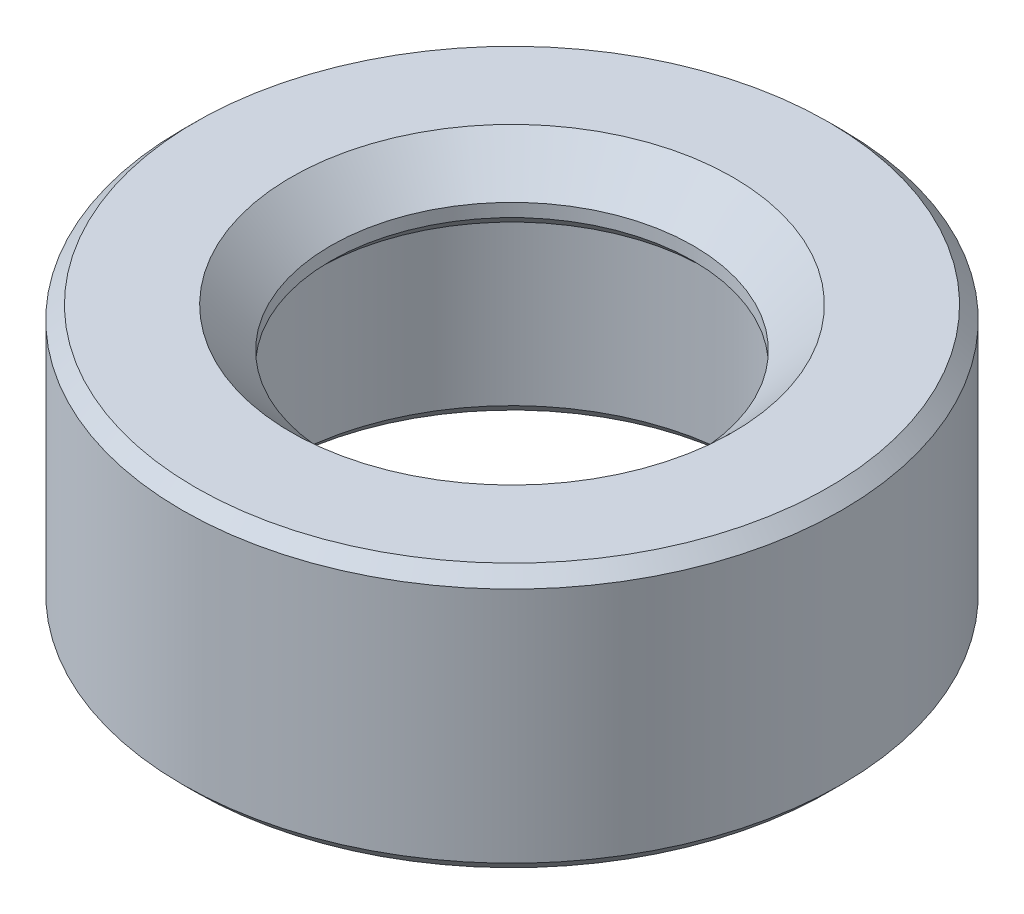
from build123d import *

# Parameters (mm, degrees)
FASE1_SIZE = 0.2
FASE2_SIZE = 0.6


with BuildPart() as part:
    # Skizze1 → Rotation1 (revolve)
    with BuildSketch(Plane(origin=(0, 0, 0), x_dir=(0, 0, -1), z_dir=(1, 0, 0)), mode=Mode.PRIVATE) as rotation1_sk:
        Polygon((3.5, -2), (3.5, 1), (2.75, 1), (2.75, 2), (5, 2), (5, -2), align=None)
    revolve(rotation1_sk.sketch.rotate(Axis((0, 14.193037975, 0), (0, -1, 0)), 180), axis=Axis((0, 14.193037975, 0), (0, -1, 0)))

    # Fase1
    fase1_edges = [part.edges().sort_by_distance(p)[0] for p in [
        (0, -2, -5),
        (0, 2, -5),
        (0, 1, -2.75),
        (0, -2, -3.5),
    ]]
    chamfer(fase1_edges, length=FASE1_SIZE)

    # Fase2
    fase2_edges = [part.edges().sort_by_distance(p)[0] for p in [
        (0, 2, -2.75),
    ]]
    chamfer(fase2_edges, length=FASE2_SIZE)


solid = part.part
